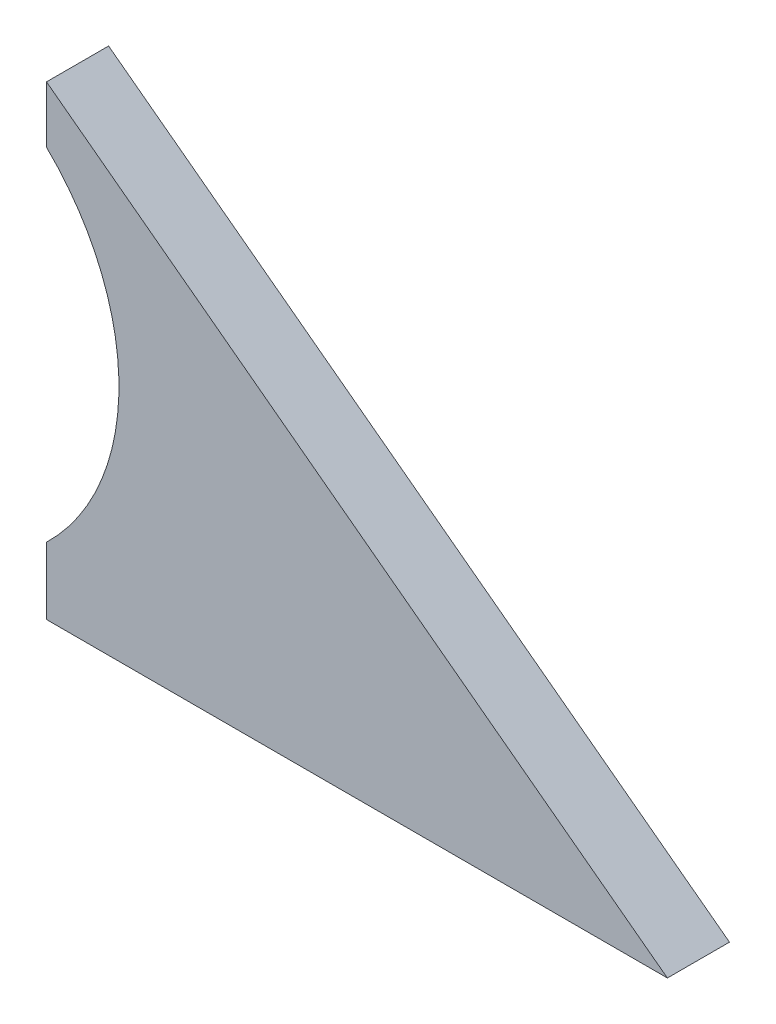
ISO-10303-21;
HEADER;
FILE_DESCRIPTION(('STEP AP214'),'2;1');
FILE_NAME('part.step','',(''),(''),'','','');
FILE_SCHEMA(('AUTOMOTIVE_DESIGN { 1 0 10303 214 1 1 1 1 }'));
ENDSEC;
DATA;
#1=APPLICATION_CONTEXT('core data for automotive mechanical design processes');
#2=APPLICATION_PROTOCOL_DEFINITION('international standard','automotive_design',2000,#1);
#3=PRODUCT_CONTEXT('',#1,'mechanical');
#4=PRODUCT('Part','Part','',(#3));
#5=PRODUCT_RELATED_PRODUCT_CATEGORY('part','',(#4));
#6=PRODUCT_DEFINITION_FORMATION('','',#4);
#7=PRODUCT_DEFINITION_CONTEXT('part definition',#1,'design');
#8=PRODUCT_DEFINITION('design','',#6,#7);
#9=PRODUCT_DEFINITION_SHAPE('','',#8);
#10=(LENGTH_UNIT() NAMED_UNIT(*) SI_UNIT(.MILLI.,.METRE.));
#11=(NAMED_UNIT(*) PLANE_ANGLE_UNIT() SI_UNIT($,.RADIAN.));
#12=(NAMED_UNIT(*) SI_UNIT($,.STERADIAN.) SOLID_ANGLE_UNIT());
#13=UNCERTAINTY_MEASURE_WITH_UNIT(LENGTH_MEASURE(1.E-05),#10,'distance_accuracy_value','');
#14=(GEOMETRIC_REPRESENTATION_CONTEXT(3) GLOBAL_UNCERTAINTY_ASSIGNED_CONTEXT((#13)) GLOBAL_UNIT_ASSIGNED_CONTEXT((#10,
#11,#12)) REPRESENTATION_CONTEXT('',''));
#15=CARTESIAN_POINT('',(0.,0.,0.));
#16=DIRECTION('',(0.,0.,1.));
#17=DIRECTION('',(1.,0.,0.));
#18=AXIS2_PLACEMENT_3D('',#15,#16,#17);
#19=CARTESIAN_POINT('',(60.,0.,6.));
#20=DIRECTION('',(-0.6,-0.8,0.));
#21=DIRECTION('',(0.8,-0.6,0.));
#22=AXIS2_PLACEMENT_3D('',#19,#20,#21);
#23=PLANE('',#22);
#24=DIRECTION('',(-0.8,0.6,0.));
#25=VECTOR('',#24,1.);
#26=CARTESIAN_POINT('',(60.,0.,0.));
#27=LINE('',#26,#25);
#28=CARTESIAN_POINT('',(60.,0.,0.));
#29=VERTEX_POINT('',#28);
#30=CARTESIAN_POINT('',(0.,45.,0.));
#31=VERTEX_POINT('',#30);
#32=EDGE_CURVE('E113',#29,#31,#27,.T.);
#33=ORIENTED_EDGE('',*,*,#32,.T.);
#34=DIRECTION('',(0.,0.,-1.));
#35=VECTOR('',#34,1.);
#36=CARTESIAN_POINT('',(0.,45.,6.));
#37=LINE('',#36,#35);
#38=CARTESIAN_POINT('',(0.,45.,6.));
#39=VERTEX_POINT('',#38);
#40=EDGE_CURVE('E11',#39,#31,#37,.T.);
#41=ORIENTED_EDGE('',*,*,#40,.F.);
#42=DIRECTION('',(-0.8,0.6,0.));
#43=VECTOR('',#42,1.);
#44=CARTESIAN_POINT('',(60.,0.,6.));
#45=LINE('',#44,#43);
#46=CARTESIAN_POINT('',(60.,0.,6.));
#47=VERTEX_POINT('',#46);
#48=EDGE_CURVE('E121',#47,#39,#45,.T.);
#49=ORIENTED_EDGE('',*,*,#48,.F.);
#50=DIRECTION('',(0.,0.,-1.));
#51=VECTOR('',#50,1.);
#52=CARTESIAN_POINT('',(60.,0.,6.));
#53=LINE('',#52,#51);
#54=EDGE_CURVE('E109',#47,#29,#53,.T.);
#55=ORIENTED_EDGE('',*,*,#54,.T.);
#56=EDGE_LOOP('',(#33,#41,#49,#55));
#57=FACE_BOUND('',#56,.T.);
#58=ADVANCED_FACE('F39',(#57),#23,.F.);
#59=CARTESIAN_POINT('',(0.,45.,6.));
#60=DIRECTION('',(1.,0.,0.));
#61=DIRECTION('',(0.,1.,0.));
#62=AXIS2_PLACEMENT_3D('',#59,#60,#61);
#63=PLANE('',#62);
#64=DIRECTION('',(0.,-1.,0.));
#65=VECTOR('',#64,1.);
#66=CARTESIAN_POINT('',(0.,45.,0.));
#67=LINE('',#66,#65);
#68=CARTESIAN_POINT('',(0.,39.5227116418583,0.));
#69=VERTEX_POINT('',#68);
#70=EDGE_CURVE('E116',#31,#69,#67,.T.);
#71=ORIENTED_EDGE('',*,*,#70,.T.);
#72=DIRECTION('',(0.,0.,-1.));
#73=VECTOR('',#72,1.);
#74=CARTESIAN_POINT('',(0.,39.5227116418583,6.));
#75=LINE('',#74,#73);
#76=CARTESIAN_POINT('',(0.,39.5227116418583,6.));
#77=VERTEX_POINT('',#76);
#78=EDGE_CURVE('E47',#77,#69,#75,.T.);
#79=ORIENTED_EDGE('',*,*,#78,.F.);
#80=DIRECTION('',(0.,-1.,0.));
#81=VECTOR('',#80,1.);
#82=CARTESIAN_POINT('',(0.,45.,6.));
#83=LINE('',#82,#81);
#84=EDGE_CURVE('E89',#39,#77,#83,.T.);
#85=ORIENTED_EDGE('',*,*,#84,.F.);
#86=ORIENTED_EDGE('',*,*,#40,.T.);
#87=EDGE_LOOP('',(#71,#79,#85,#86));
#88=FACE_BOUND('',#87,.T.);
#89=ADVANCED_FACE('F140',(#88),#63,.F.);
#90=CARTESIAN_POINT('',(-16.,23.,6.));
#91=DIRECTION('',(0.,0.,-1.));
#92=DIRECTION('',(-1.,0.,0.));
#93=AXIS2_PLACEMENT_3D('',#90,#91,#92);
#94=CYLINDRICAL_SURFACE('',#93,23.);
#95=CARTESIAN_POINT('',(-16.,23.,0.));
#96=DIRECTION('',(0.,0.,-1.));
#97=DIRECTION('',(1.,0.,0.));
#98=AXIS2_PLACEMENT_3D('',#95,#96,#97);
#99=CIRCLE('',#98,23.);
#100=CARTESIAN_POINT('',(0.,6.47728835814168,0.));
#101=VERTEX_POINT('',#100);
#102=EDGE_CURVE('E104',#69,#101,#99,.T.);
#103=ORIENTED_EDGE('',*,*,#102,.T.);
#104=DIRECTION('',(0.,0.,-1.));
#105=VECTOR('',#104,1.);
#106=CARTESIAN_POINT('',(0.,6.47728835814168,6.));
#107=LINE('',#106,#105);
#108=CARTESIAN_POINT('',(0.,6.47728835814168,6.));
#109=VERTEX_POINT('',#108);
#110=EDGE_CURVE('E101',#109,#101,#107,.T.);
#111=ORIENTED_EDGE('',*,*,#110,.F.);
#112=CARTESIAN_POINT('',(-16.,23.,6.));
#113=DIRECTION('',(0.,0.,-1.));
#114=DIRECTION('',(1.,0.,0.));
#115=AXIS2_PLACEMENT_3D('',#112,#113,#114);
#116=CIRCLE('',#115,23.);
#117=EDGE_CURVE('E93',#77,#109,#116,.T.);
#118=ORIENTED_EDGE('',*,*,#117,.F.);
#119=ORIENTED_EDGE('',*,*,#78,.T.);
#120=EDGE_LOOP('',(#103,#111,#118,#119));
#121=FACE_BOUND('',#120,.T.);
#122=ADVANCED_FACE('F102',(#121),#94,.F.);
#123=CARTESIAN_POINT('',(0.,6.47728835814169,6.));
#124=DIRECTION('',(1.,0.,0.));
#125=DIRECTION('',(0.,1.,0.));
#126=AXIS2_PLACEMENT_3D('',#123,#124,#125);
#127=PLANE('',#126);
#128=DIRECTION('',(0.,-1.,0.));
#129=VECTOR('',#128,1.);
#130=CARTESIAN_POINT('',(0.,6.47728835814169,0.));
#131=LINE('',#130,#129);
#132=CARTESIAN_POINT('',(0.,0.,0.));
#133=VERTEX_POINT('',#132);
#134=EDGE_CURVE('E75',#101,#133,#131,.T.);
#135=ORIENTED_EDGE('',*,*,#134,.T.);
#136=DIRECTION('',(0.,0.,-1.));
#137=VECTOR('',#136,1.);
#138=CARTESIAN_POINT('',(0.,0.,6.));
#139=LINE('',#138,#137);
#140=CARTESIAN_POINT('',(0.,0.,6.));
#141=VERTEX_POINT('',#140);
#142=EDGE_CURVE('E105',#141,#133,#139,.T.);
#143=ORIENTED_EDGE('',*,*,#142,.F.);
#144=DIRECTION('',(0.,-1.,0.));
#145=VECTOR('',#144,1.);
#146=CARTESIAN_POINT('',(0.,6.47728835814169,6.));
#147=LINE('',#146,#145);
#148=EDGE_CURVE('E97',#109,#141,#147,.T.);
#149=ORIENTED_EDGE('',*,*,#148,.F.);
#150=ORIENTED_EDGE('',*,*,#110,.T.);
#151=EDGE_LOOP('',(#135,#143,#149,#150));
#152=FACE_BOUND('',#151,.T.);
#153=ADVANCED_FACE('F107',(#152),#127,.F.);
#154=CARTESIAN_POINT('',(0.,0.,6.));
#155=DIRECTION('',(0.,1.,0.));
#156=DIRECTION('',(0.,0.,1.));
#157=AXIS2_PLACEMENT_3D('',#154,#155,#156);
#158=PLANE('',#157);
#159=DIRECTION('',(1.,0.,0.));
#160=VECTOR('',#159,1.);
#161=CARTESIAN_POINT('',(0.,0.,0.));
#162=LINE('',#161,#160);
#163=EDGE_CURVE('E81',#133,#29,#162,.T.);
#164=ORIENTED_EDGE('',*,*,#163,.T.);
#165=ORIENTED_EDGE('',*,*,#54,.F.);
#166=DIRECTION('',(1.,0.,0.));
#167=VECTOR('',#166,1.);
#168=CARTESIAN_POINT('',(0.,0.,6.));
#169=LINE('',#168,#167);
#170=EDGE_CURVE('E55',#141,#47,#169,.T.);
#171=ORIENTED_EDGE('',*,*,#170,.F.);
#172=ORIENTED_EDGE('',*,*,#142,.T.);
#173=EDGE_LOOP('',(#164,#165,#171,#172));
#174=FACE_BOUND('',#173,.T.);
#175=ADVANCED_FACE('F129',(#174),#158,.F.);
#176=CARTESIAN_POINT('',(-16.,23.,6.));
#177=DIRECTION('',(0.,0.,1.));
#178=DIRECTION('',(1.,0.,0.));
#179=AXIS2_PLACEMENT_3D('',#176,#177,#178);
#180=PLANE('',#179);
#181=ORIENTED_EDGE('',*,*,#48,.T.);
#182=ORIENTED_EDGE('',*,*,#84,.T.);
#183=ORIENTED_EDGE('',*,*,#117,.T.);
#184=ORIENTED_EDGE('',*,*,#148,.T.);
#185=ORIENTED_EDGE('',*,*,#170,.T.);
#186=EDGE_LOOP('',(#181,#182,#183,#184,#185));
#187=FACE_BOUND('',#186,.T.);
#188=ADVANCED_FACE('F95',(#187),#180,.T.);
#189=CARTESIAN_POINT('',(-16.,23.,0.));
#190=DIRECTION('',(0.,0.,1.));
#191=DIRECTION('',(1.,0.,0.));
#192=AXIS2_PLACEMENT_3D('',#189,#190,#191);
#193=PLANE('',#192);
#194=ORIENTED_EDGE('',*,*,#32,.F.);
#195=ORIENTED_EDGE('',*,*,#163,.F.);
#196=ORIENTED_EDGE('',*,*,#134,.F.);
#197=ORIENTED_EDGE('',*,*,#102,.F.);
#198=ORIENTED_EDGE('',*,*,#70,.F.);
#199=EDGE_LOOP('',(#194,#195,#196,#197,#198));
#200=FACE_BOUND('',#199,.T.);
#201=ADVANCED_FACE('F125',(#200),#193,.F.);
#202=CLOSED_SHELL('',(#58,#89,#122,#153,#175,#188,#201));
#203=MANIFOLD_SOLID_BREP('B2',#202);
#204=ADVANCED_BREP_SHAPE_REPRESENTATION('',(#18,#203),#14);
#205=SHAPE_DEFINITION_REPRESENTATION(#9,#204);
ENDSEC;
END-ISO-10303-21;
